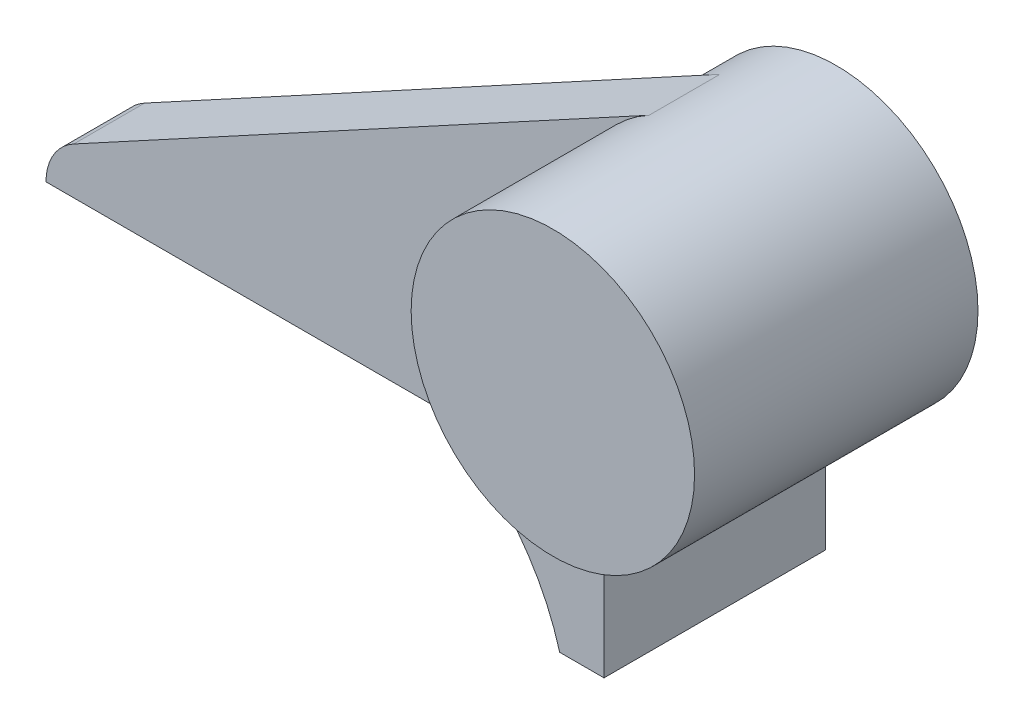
ISO-10303-21;
HEADER;
FILE_DESCRIPTION(('STEP AP214'),'2;1');
FILE_NAME('part.step','',(''),(''),'','','');
FILE_SCHEMA(('AUTOMOTIVE_DESIGN { 1 0 10303 214 1 1 1 1 }'));
ENDSEC;
DATA;
#1=APPLICATION_CONTEXT('core data for automotive mechanical design processes');
#2=APPLICATION_PROTOCOL_DEFINITION('international standard','automotive_design',2000,#1);
#3=PRODUCT_CONTEXT('',#1,'mechanical');
#4=PRODUCT('Part','Part','',(#3));
#5=PRODUCT_RELATED_PRODUCT_CATEGORY('part','',(#4));
#6=PRODUCT_DEFINITION_FORMATION('','',#4);
#7=PRODUCT_DEFINITION_CONTEXT('part definition',#1,'design');
#8=PRODUCT_DEFINITION('design','',#6,#7);
#9=PRODUCT_DEFINITION_SHAPE('','',#8);
#10=(LENGTH_UNIT() NAMED_UNIT(*) SI_UNIT(.MILLI.,.METRE.));
#11=(NAMED_UNIT(*) PLANE_ANGLE_UNIT() SI_UNIT($,.RADIAN.));
#12=(NAMED_UNIT(*) SI_UNIT($,.STERADIAN.) SOLID_ANGLE_UNIT());
#13=UNCERTAINTY_MEASURE_WITH_UNIT(LENGTH_MEASURE(1.E-05),#10,'distance_accuracy_value','');
#14=(GEOMETRIC_REPRESENTATION_CONTEXT(3) GLOBAL_UNCERTAINTY_ASSIGNED_CONTEXT((#13)) GLOBAL_UNIT_ASSIGNED_CONTEXT((#10,
#11,#12)) REPRESENTATION_CONTEXT('',''));
#15=CARTESIAN_POINT('',(0.,0.,0.));
#16=DIRECTION('',(0.,0.,1.));
#17=DIRECTION('',(1.,0.,0.));
#18=AXIS2_PLACEMENT_3D('',#15,#16,#17);
#19=CARTESIAN_POINT('',(151.451853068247,75.,-73.));
#20=DIRECTION('',(0.,0.,-1.));
#21=DIRECTION('',(-1.,0.,0.));
#22=AXIS2_PLACEMENT_3D('',#19,#20,#21);
#23=PLANE('',#22);
#24=DIRECTION('',(-1.,0.,0.));
#25=VECTOR('',#24,1.);
#26=CARTESIAN_POINT('',(160.,22.,-73.));
#27=LINE('',#26,#25);
#28=CARTESIAN_POINT('',(150.,22.,-73.));
#29=VERTEX_POINT('',#28);
#30=CARTESIAN_POINT('',(0.,22.,-73.));
#31=VERTEX_POINT('',#30);
#32=EDGE_CURVE('E100',#29,#31,#27,.T.);
#33=ORIENTED_EDGE('',*,*,#32,.F.);
#34=CARTESIAN_POINT('',(97.0560874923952,7.10227774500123,-73.));
#35=DIRECTION('',(0.,0.,-1.));
#36=DIRECTION('',(-1.,0.,0.));
#37=AXIS2_PLACEMENT_3D('',#34,#35,#36);
#38=CIRCLE('',#37,55.);
#39=CARTESIAN_POINT('',(131.44421515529,50.0261251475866,-73.));
#40=VERTEX_POINT('',#39);
#41=EDGE_CURVE('E50',#29,#40,#38,.F.);
#42=ORIENTED_EDGE('',*,*,#41,.T.);
#43=CARTESIAN_POINT('',(151.451853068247,75.,-73.));
#44=DIRECTION('',(0.,0.,-1.));
#45=DIRECTION('',(-1.,0.,0.));
#46=AXIS2_PLACEMENT_3D('',#43,#44,#45);
#47=CIRCLE('',#46,32.);
#48=CARTESIAN_POINT('',(136.175804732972,103.118363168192,-73.));
#49=VERTEX_POINT('',#48);
#50=EDGE_CURVE('E119',#40,#49,#47,.T.);
#51=ORIENTED_EDGE('',*,*,#50,.T.);
#52=DIRECTION('',(0.878698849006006,0.477376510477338,0.));
#53=VECTOR('',#52,1.);
#54=CARTESIAN_POINT('',(6.27148187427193,32.5443861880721,-73.));
#55=LINE('',#54,#53);
#56=CARTESIAN_POINT('',(6.27148187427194,32.5443861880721,-73.));
#57=VERTEX_POINT('',#56);
#58=EDGE_CURVE('E129',#57,#49,#55,.T.);
#59=ORIENTED_EDGE('',*,*,#58,.F.);
#60=CARTESIAN_POINT('',(12.,22.,-73.));
#61=DIRECTION('',(0.,0.,-1.));
#62=DIRECTION('',(-1.,0.,0.));
#63=AXIS2_PLACEMENT_3D('',#60,#61,#62);
#64=CIRCLE('',#63,12.);
#65=EDGE_CURVE('E132',#31,#57,#64,.T.);
#66=ORIENTED_EDGE('',*,*,#65,.F.);
#67=EDGE_LOOP('',(#33,#42,#51,#59,#66));
#68=FACE_BOUND('',#67,.T.);
#69=ADVANCED_FACE('F28',(#68),#23,.F.);
#70=CARTESIAN_POINT('',(160.,22.,-73.));
#71=DIRECTION('',(-1.,0.,0.));
#72=DIRECTION('',(0.,-1.,0.));
#73=AXIS2_PLACEMENT_3D('',#70,#71,#72);
#74=PLANE('',#73);
#75=DIRECTION('',(0.,1.,0.));
#76=VECTOR('',#75,1.);
#77=CARTESIAN_POINT('',(160.,22.,-89.));
#78=LINE('',#77,#76);
#79=CARTESIAN_POINT('',(160.,22.,-89.));
#80=VERTEX_POINT('',#79);
#81=CARTESIAN_POINT('',(160.,44.1628603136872,-89.));
#82=VERTEX_POINT('',#81);
#83=EDGE_CURVE('E121',#80,#82,#78,.T.);
#84=ORIENTED_EDGE('',*,*,#83,.T.);
#85=DIRECTION('',(0.,0.,-1.));
#86=VECTOR('',#85,1.);
#87=CARTESIAN_POINT('',(160.,44.1628603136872,-73.));
#88=LINE('',#87,#86);
#89=CARTESIAN_POINT('',(160.,44.1628603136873,-39.));
#90=VERTEX_POINT('',#89);
#91=EDGE_CURVE('E104',#90,#82,#88,.T.);
#92=ORIENTED_EDGE('',*,*,#91,.F.);
#93=DIRECTION('',(0.,-1.,0.));
#94=VECTOR('',#93,1.);
#95=CARTESIAN_POINT('',(160.,107.001,-39.));
#96=LINE('',#95,#94);
#97=CARTESIAN_POINT('',(160.,22.,-39.));
#98=VERTEX_POINT('',#97);
#99=EDGE_CURVE('E102',#90,#98,#96,.T.);
#100=ORIENTED_EDGE('',*,*,#99,.T.);
#101=DIRECTION('',(0.,0.,-1.));
#102=VECTOR('',#101,1.);
#103=CARTESIAN_POINT('',(160.,22.,-73.));
#104=LINE('',#103,#102);
#105=EDGE_CURVE('E87',#98,#80,#104,.T.);
#106=ORIENTED_EDGE('',*,*,#105,.T.);
#107=EDGE_LOOP('',(#84,#92,#100,#106));
#108=FACE_BOUND('',#107,.T.);
#109=ADVANCED_FACE('F30',(#108),#74,.F.);
#110=CARTESIAN_POINT('',(151.451853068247,75.,-73.));
#111=DIRECTION('',(0.,0.,-1.));
#112=DIRECTION('',(-1.,0.,0.));
#113=AXIS2_PLACEMENT_3D('',#110,#111,#112);
#114=CYLINDRICAL_SURFACE('',#113,32.);
#115=ORIENTED_EDGE('',*,*,#50,.F.);
#116=DIRECTION('',(0.,0.,-1.));
#117=VECTOR('',#116,1.);
#118=CARTESIAN_POINT('',(131.44421515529,50.0261251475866,-73.));
#119=LINE('',#118,#117);
#120=CARTESIAN_POINT('',(131.44421515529,50.0261251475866,-39.));
#121=VERTEX_POINT('',#120);
#122=EDGE_CURVE('E36',#40,#121,#119,.F.);
#123=ORIENTED_EDGE('',*,*,#122,.T.);
#124=CARTESIAN_POINT('',(151.451853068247,75.,-39.));
#125=DIRECTION('',(0.,0.,1.));
#126=DIRECTION('',(1.,0.,0.));
#127=AXIS2_PLACEMENT_3D('',#124,#125,#126);
#128=CIRCLE('',#127,32.);
#129=EDGE_CURVE('E42',#121,#90,#128,.T.);
#130=ORIENTED_EDGE('',*,*,#129,.T.);
#131=ORIENTED_EDGE('',*,*,#91,.T.);
#132=CARTESIAN_POINT('',(151.451853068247,75.,-89.));
#133=DIRECTION('',(0.,0.,-1.));
#134=DIRECTION('',(-1.,0.,0.));
#135=AXIS2_PLACEMENT_3D('',#132,#133,#134);
#136=CIRCLE('',#135,32.);
#137=CARTESIAN_POINT('',(136.175804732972,103.118363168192,-89.));
#138=VERTEX_POINT('',#137);
#139=EDGE_CURVE('E143',#82,#138,#136,.T.);
#140=ORIENTED_EDGE('',*,*,#139,.T.);
#141=DIRECTION('',(0.,0.,-1.));
#142=VECTOR('',#141,1.);
#143=CARTESIAN_POINT('',(136.175804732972,103.118363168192,-73.));
#144=LINE('',#143,#142);
#145=EDGE_CURVE('E139',#49,#138,#144,.T.);
#146=ORIENTED_EDGE('',*,*,#145,.F.);
#147=EDGE_LOOP('',(#115,#123,#130,#131,#140,#146));
#148=FACE_BOUND('',#147,.T.);
#149=CARTESIAN_POINT('',(151.451853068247,75.,-100.));
#150=DIRECTION('',(0.,0.,-1.));
#151=DIRECTION('',(-1.,0.,0.));
#152=AXIS2_PLACEMENT_3D('',#149,#150,#151);
#153=CIRCLE('',#152,32.);
#154=CARTESIAN_POINT('',(119.451853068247,75.,-100.));
#155=VERTEX_POINT('',#154);
#156=EDGE_CURVE('E110',#155,#155,#153,.T.);
#157=ORIENTED_EDGE('',*,*,#156,.F.);
#158=EDGE_LOOP('',(#157));
#159=FACE_BOUND('',#158,.T.);
#160=CARTESIAN_POINT('',(151.451853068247,75.,-36.));
#161=DIRECTION('',(0.,0.,-1.));
#162=DIRECTION('',(-1.,0.,0.));
#163=AXIS2_PLACEMENT_3D('',#160,#161,#162);
#164=CIRCLE('',#163,32.);
#165=CARTESIAN_POINT('',(119.451853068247,75.,-36.));
#166=VERTEX_POINT('',#165);
#167=EDGE_CURVE('E116',#166,#166,#164,.T.);
#168=ORIENTED_EDGE('',*,*,#167,.T.);
#169=EDGE_LOOP('',(#168));
#170=FACE_BOUND('',#169,.T.);
#171=ADVANCED_FACE('F148',(#148,#159,#170),#114,.T.);
#172=CARTESIAN_POINT('',(6.27148187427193,32.5443861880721,-73.));
#173=DIRECTION('',(-0.477376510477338,0.878698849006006,0.));
#174=DIRECTION('',(-0.878698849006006,-0.477376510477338,0.));
#175=AXIS2_PLACEMENT_3D('',#172,#173,#174);
#176=PLANE('',#175);
#177=DIRECTION('',(0.878698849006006,0.477376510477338,0.));
#178=VECTOR('',#177,1.);
#179=CARTESIAN_POINT('',(6.27148187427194,32.5443861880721,-89.));
#180=LINE('',#179,#178);
#181=CARTESIAN_POINT('',(6.27148187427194,32.5443861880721,-89.));
#182=VERTEX_POINT('',#181);
#183=EDGE_CURVE('E123',#182,#138,#180,.T.);
#184=ORIENTED_EDGE('',*,*,#183,.F.);
#185=DIRECTION('',(0.,0.,-1.));
#186=VECTOR('',#185,1.);
#187=CARTESIAN_POINT('',(6.27148187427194,32.5443861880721,-73.));
#188=LINE('',#187,#186);
#189=EDGE_CURVE('E137',#57,#182,#188,.T.);
#190=ORIENTED_EDGE('',*,*,#189,.F.);
#191=ORIENTED_EDGE('',*,*,#58,.T.);
#192=ORIENTED_EDGE('',*,*,#145,.T.);
#193=EDGE_LOOP('',(#184,#190,#191,#192));
#194=FACE_BOUND('',#193,.T.);
#195=ADVANCED_FACE('F163',(#194),#176,.T.);
#196=CARTESIAN_POINT('',(12.,22.,-73.));
#197=DIRECTION('',(0.,0.,-1.));
#198=DIRECTION('',(-1.,0.,0.));
#199=AXIS2_PLACEMENT_3D('',#196,#197,#198);
#200=CYLINDRICAL_SURFACE('',#199,12.);
#201=CARTESIAN_POINT('',(12.,22.,-89.));
#202=DIRECTION('',(0.,0.,-1.));
#203=DIRECTION('',(-1.,0.,0.));
#204=AXIS2_PLACEMENT_3D('',#201,#202,#203);
#205=CIRCLE('',#204,12.);
#206=CARTESIAN_POINT('',(0.,22.,-89.));
#207=VERTEX_POINT('',#206);
#208=EDGE_CURVE('E125',#207,#182,#205,.T.);
#209=ORIENTED_EDGE('',*,*,#208,.F.);
#210=DIRECTION('',(0.,0.,-1.));
#211=VECTOR('',#210,1.);
#212=CARTESIAN_POINT('',(0.,22.,-73.));
#213=LINE('',#212,#211);
#214=EDGE_CURVE('E99',#31,#207,#213,.T.);
#215=ORIENTED_EDGE('',*,*,#214,.F.);
#216=ORIENTED_EDGE('',*,*,#65,.T.);
#217=ORIENTED_EDGE('',*,*,#189,.T.);
#218=EDGE_LOOP('',(#209,#215,#216,#217));
#219=FACE_BOUND('',#218,.T.);
#220=ADVANCED_FACE('F158',(#219),#200,.T.);
#221=CARTESIAN_POINT('',(160.,22.,-73.));
#222=DIRECTION('',(0.,-1.,0.));
#223=DIRECTION('',(0.,0.,-1.));
#224=AXIS2_PLACEMENT_3D('',#221,#222,#223);
#225=PLANE('',#224);
#226=DIRECTION('',(-1.,0.,0.));
#227=VECTOR('',#226,1.);
#228=CARTESIAN_POINT('',(160.,22.,-89.));
#229=LINE('',#228,#227);
#230=EDGE_CURVE('E95',#80,#207,#229,.T.);
#231=ORIENTED_EDGE('',*,*,#230,.F.);
#232=ORIENTED_EDGE('',*,*,#105,.F.);
#233=DIRECTION('',(-1.,0.,0.));
#234=VECTOR('',#233,1.);
#235=CARTESIAN_POINT('',(160.,22.,-39.));
#236=LINE('',#235,#234);
#237=CARTESIAN_POINT('',(150.,22.,-39.));
#238=VERTEX_POINT('',#237);
#239=EDGE_CURVE('E92',#98,#238,#236,.T.);
#240=ORIENTED_EDGE('',*,*,#239,.T.);
#241=DIRECTION('',(0.,0.,1.));
#242=VECTOR('',#241,1.);
#243=CARTESIAN_POINT('',(150.,22.,-73.));
#244=LINE('',#243,#242);
#245=EDGE_CURVE('E105',#29,#238,#244,.T.);
#246=ORIENTED_EDGE('',*,*,#245,.F.);
#247=ORIENTED_EDGE('',*,*,#32,.T.);
#248=ORIENTED_EDGE('',*,*,#214,.T.);
#249=EDGE_LOOP('',(#231,#232,#240,#246,#247,#248));
#250=FACE_BOUND('',#249,.T.);
#251=ADVANCED_FACE('F89',(#250),#225,.T.);
#252=CARTESIAN_POINT('',(151.451853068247,75.,-89.));
#253=DIRECTION('',(0.,0.,-1.));
#254=DIRECTION('',(-1.,0.,0.));
#255=AXIS2_PLACEMENT_3D('',#252,#253,#254);
#256=PLANE('',#255);
#257=ORIENTED_EDGE('',*,*,#139,.F.);
#258=ORIENTED_EDGE('',*,*,#83,.F.);
#259=ORIENTED_EDGE('',*,*,#230,.T.);
#260=ORIENTED_EDGE('',*,*,#208,.T.);
#261=ORIENTED_EDGE('',*,*,#183,.T.);
#262=EDGE_LOOP('',(#257,#258,#259,#260,#261));
#263=FACE_BOUND('',#262,.T.);
#264=ADVANCED_FACE('F161',(#263),#256,.T.);
#265=CARTESIAN_POINT('',(151.451853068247,75.,-100.));
#266=DIRECTION('',(0.,0.,-1.));
#267=DIRECTION('',(-1.,0.,0.));
#268=AXIS2_PLACEMENT_3D('',#265,#266,#267);
#269=PLANE('',#268);
#270=ORIENTED_EDGE('',*,*,#156,.T.);
#271=EDGE_LOOP('',(#270));
#272=FACE_BOUND('',#271,.T.);
#273=ADVANCED_FACE('F184',(#272),#269,.T.);
#274=CARTESIAN_POINT('',(151.451853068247,75.,-36.));
#275=DIRECTION('',(0.,0.,-1.));
#276=DIRECTION('',(-1.,0.,0.));
#277=AXIS2_PLACEMENT_3D('',#274,#275,#276);
#278=PLANE('',#277);
#279=ORIENTED_EDGE('',*,*,#167,.F.);
#280=EDGE_LOOP('',(#279));
#281=FACE_BOUND('',#280,.T.);
#282=ADVANCED_FACE('F188',(#281),#278,.F.);
#283=CARTESIAN_POINT('',(160.,107.001,-39.));
#284=DIRECTION('',(0.,0.,1.));
#285=DIRECTION('',(1.,0.,0.));
#286=AXIS2_PLACEMENT_3D('',#283,#284,#285);
#287=PLANE('',#286);
#288=ORIENTED_EDGE('',*,*,#129,.F.);
#289=CARTESIAN_POINT('',(97.0560874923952,7.10227774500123,-39.));
#290=DIRECTION('',(0.,0.,1.));
#291=DIRECTION('',(1.,0.,0.));
#292=AXIS2_PLACEMENT_3D('',#289,#290,#291);
#293=CIRCLE('',#292,55.);
#294=EDGE_CURVE('E11',#121,#238,#293,.F.);
#295=ORIENTED_EDGE('',*,*,#294,.T.);
#296=ORIENTED_EDGE('',*,*,#239,.F.);
#297=ORIENTED_EDGE('',*,*,#99,.F.);
#298=EDGE_LOOP('',(#288,#295,#296,#297));
#299=FACE_BOUND('',#298,.T.);
#300=ADVANCED_FACE('F107',(#299),#287,.T.);
#301=CARTESIAN_POINT('',(97.0560874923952,7.10227774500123,-73.));
#302=DIRECTION('',(0.,0.,1.));
#303=DIRECTION('',(1.,0.,0.));
#304=AXIS2_PLACEMENT_3D('',#301,#302,#303);
#305=CYLINDRICAL_SURFACE('',#304,55.);
#306=ORIENTED_EDGE('',*,*,#294,.F.);
#307=ORIENTED_EDGE('',*,*,#122,.F.);
#308=ORIENTED_EDGE('',*,*,#41,.F.);
#309=ORIENTED_EDGE('',*,*,#245,.T.);
#310=EDGE_LOOP('',(#306,#307,#308,#309));
#311=FACE_BOUND('',#310,.T.);
#312=ADVANCED_FACE('F152',(#311),#305,.F.);
#313=CLOSED_SHELL('',(#69,#109,#171,#195,#220,#251,#264,#273,#282,#300,#312));
#314=MANIFOLD_SOLID_BREP('B2',#313);
#315=ADVANCED_BREP_SHAPE_REPRESENTATION('',(#18,#314),#14);
#316=SHAPE_DEFINITION_REPRESENTATION(#9,#315);
ENDSEC;
END-ISO-10303-21;
